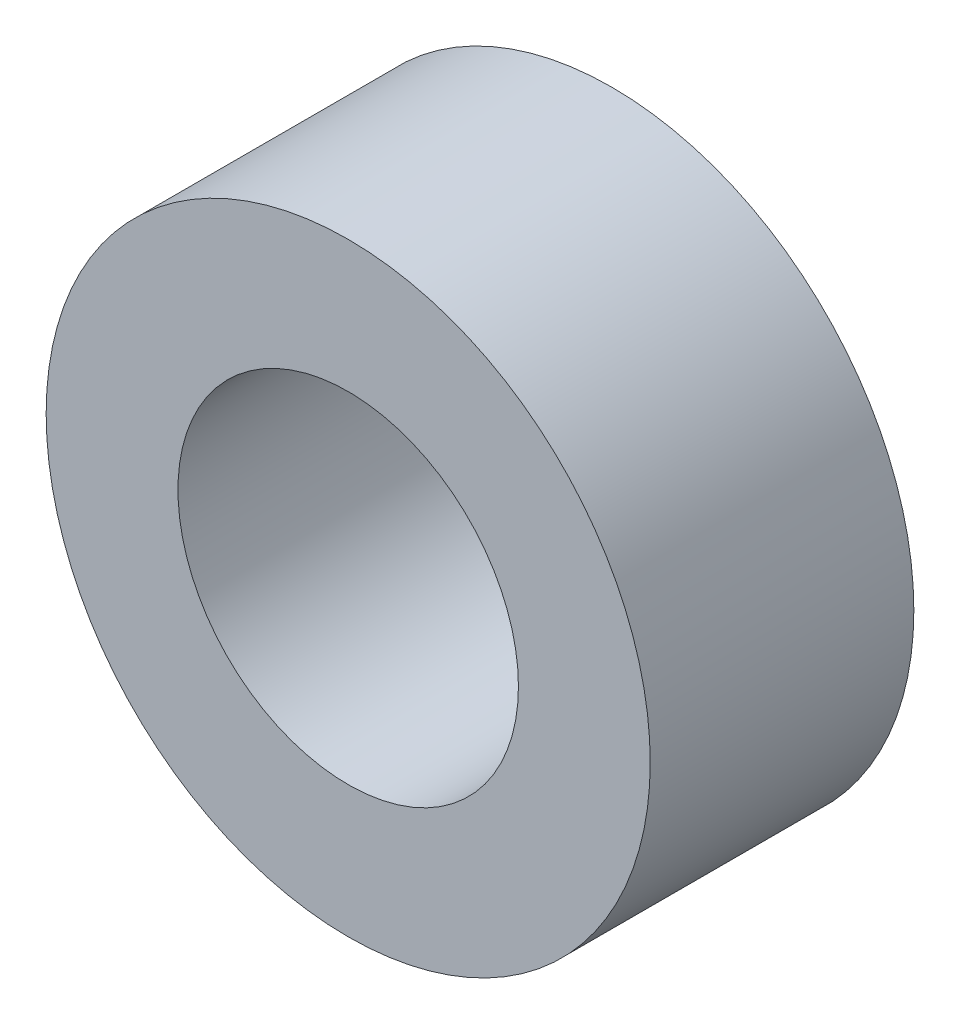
ISO-10303-21;
HEADER;
FILE_DESCRIPTION(('STEP AP214'),'2;1');
FILE_NAME('part.step','',(''),(''),'','','');
FILE_SCHEMA(('AUTOMOTIVE_DESIGN { 1 0 10303 214 1 1 1 1 }'));
ENDSEC;
DATA;
#1=APPLICATION_CONTEXT('core data for automotive mechanical design processes');
#2=APPLICATION_PROTOCOL_DEFINITION('international standard','automotive_design',2000,#1);
#3=PRODUCT_CONTEXT('',#1,'mechanical');
#4=PRODUCT('Part','Part','',(#3));
#5=PRODUCT_RELATED_PRODUCT_CATEGORY('part','',(#4));
#6=PRODUCT_DEFINITION_FORMATION('','',#4);
#7=PRODUCT_DEFINITION_CONTEXT('part definition',#1,'design');
#8=PRODUCT_DEFINITION('design','',#6,#7);
#9=PRODUCT_DEFINITION_SHAPE('','',#8);
#10=(LENGTH_UNIT() NAMED_UNIT(*) SI_UNIT(.MILLI.,.METRE.));
#11=(NAMED_UNIT(*) PLANE_ANGLE_UNIT() SI_UNIT($,.RADIAN.));
#12=(NAMED_UNIT(*) SI_UNIT($,.STERADIAN.) SOLID_ANGLE_UNIT());
#13=UNCERTAINTY_MEASURE_WITH_UNIT(LENGTH_MEASURE(1.E-05),#10,'distance_accuracy_value','');
#14=(GEOMETRIC_REPRESENTATION_CONTEXT(3) GLOBAL_UNCERTAINTY_ASSIGNED_CONTEXT((#13)) GLOBAL_UNIT_ASSIGNED_CONTEXT((#10,
#11,#12)) REPRESENTATION_CONTEXT('',''));
#15=CARTESIAN_POINT('',(0.,0.,0.));
#16=DIRECTION('',(0.,0.,1.));
#17=DIRECTION('',(1.,0.,0.));
#18=AXIS2_PLACEMENT_3D('',#15,#16,#17);
#19=CARTESIAN_POINT('',(0.,-48.5,-13.));
#20=DIRECTION('',(0.,0.,1.));
#21=DIRECTION('',(1.,0.,0.));
#22=AXIS2_PLACEMENT_3D('',#19,#20,#21);
#23=CYLINDRICAL_SURFACE('',#22,1.55);
#24=DIRECTION('',(0.,0.,1.));
#25=VECTOR('',#24,1.);
#26=CARTESIAN_POINT('',(1.55,-48.5,-13.));
#27=LINE('',#26,#25);
#28=CARTESIAN_POINT('',(1.55,-48.5,-13.));
#29=VERTEX_POINT('',#28);
#30=CARTESIAN_POINT('',(1.55,-48.5,-10.6));
#31=VERTEX_POINT('',#30);
#32=EDGE_CURVE('E10',#29,#31,#27,.T.);
#33=ORIENTED_EDGE('',*,*,#32,.F.);
#34=CARTESIAN_POINT('',(0.,-48.5,-13.));
#35=DIRECTION('',(0.,0.,1.));
#36=DIRECTION('',(1.,0.,0.));
#37=AXIS2_PLACEMENT_3D('',#34,#35,#36);
#38=CIRCLE('',#37,1.55);
#39=EDGE_CURVE('E27',#29,#29,#38,.T.);
#40=ORIENTED_EDGE('',*,*,#39,.F.);
#41=ORIENTED_EDGE('',*,*,#32,.T.);
#42=CARTESIAN_POINT('',(0.,-48.5,-10.6));
#43=DIRECTION('',(0.,0.,1.));
#44=DIRECTION('',(1.,0.,0.));
#45=AXIS2_PLACEMENT_3D('',#42,#43,#44);
#46=CIRCLE('',#45,1.55);
#47=EDGE_CURVE('E20',#31,#31,#46,.T.);
#48=ORIENTED_EDGE('',*,*,#47,.T.);
#49=EDGE_LOOP('',(#33,#40,#41,#48));
#50=FACE_BOUND('',#49,.T.);
#51=ADVANCED_FACE('F16',(#50),#23,.F.);
#52=CARTESIAN_POINT('',(0.,-48.5,-13.));
#53=DIRECTION('',(0.,0.,1.));
#54=DIRECTION('',(0.,-1.,0.));
#55=AXIS2_PLACEMENT_3D('',#52,#53,#54);
#56=PLANE('',#55);
#57=ORIENTED_EDGE('',*,*,#39,.T.);
#58=EDGE_LOOP('',(#57));
#59=FACE_BOUND('',#58,.T.);
#60=CARTESIAN_POINT('',(0.,-48.5,-13.));
#61=DIRECTION('',(0.,0.,1.));
#62=DIRECTION('',(1.,0.,0.));
#63=AXIS2_PLACEMENT_3D('',#60,#61,#62);
#64=CIRCLE('',#63,2.75);
#65=CARTESIAN_POINT('',(2.75,-48.5,-13.));
#66=VERTEX_POINT('',#65);
#67=EDGE_CURVE('E55',#66,#66,#64,.T.);
#68=ORIENTED_EDGE('',*,*,#67,.F.);
#69=EDGE_LOOP('',(#68));
#70=FACE_BOUND('',#69,.T.);
#71=ADVANCED_FACE('F72',(#59,#70),#56,.F.);
#72=CARTESIAN_POINT('',(0.,-48.5,-10.6));
#73=DIRECTION('',(0.,0.,1.));
#74=DIRECTION('',(0.,-1.,0.));
#75=AXIS2_PLACEMENT_3D('',#72,#73,#74);
#76=PLANE('',#75);
#77=ORIENTED_EDGE('',*,*,#47,.F.);
#78=EDGE_LOOP('',(#77));
#79=FACE_BOUND('',#78,.T.);
#80=CARTESIAN_POINT('',(0.,-48.5,-10.6));
#81=DIRECTION('',(0.,0.,1.));
#82=DIRECTION('',(1.,0.,0.));
#83=AXIS2_PLACEMENT_3D('',#80,#81,#82);
#84=CIRCLE('',#83,2.75);
#85=CARTESIAN_POINT('',(2.75,-48.5,-10.6));
#86=VERTEX_POINT('',#85);
#87=EDGE_CURVE('E63',#86,#86,#84,.T.);
#88=ORIENTED_EDGE('',*,*,#87,.T.);
#89=EDGE_LOOP('',(#88));
#90=FACE_BOUND('',#89,.T.);
#91=ADVANCED_FACE('F70',(#79,#90),#76,.T.);
#92=CARTESIAN_POINT('',(0.,-48.5,-13.));
#93=DIRECTION('',(0.,0.,1.));
#94=DIRECTION('',(1.,0.,0.));
#95=AXIS2_PLACEMENT_3D('',#92,#93,#94);
#96=CYLINDRICAL_SURFACE('',#95,2.75);
#97=ORIENTED_EDGE('',*,*,#87,.F.);
#98=DIRECTION('',(0.,0.,1.));
#99=VECTOR('',#98,1.);
#100=CARTESIAN_POINT('',(2.75,-48.5,-13.));
#101=LINE('',#100,#99);
#102=EDGE_CURVE('E50',#66,#86,#101,.T.);
#103=ORIENTED_EDGE('',*,*,#102,.F.);
#104=ORIENTED_EDGE('',*,*,#67,.T.);
#105=ORIENTED_EDGE('',*,*,#102,.T.);
#106=EDGE_LOOP('',(#97,#103,#104,#105));
#107=FACE_BOUND('',#106,.T.);
#108=ADVANCED_FACE('F18',(#107),#96,.T.);
#109=CLOSED_SHELL('',(#51,#71,#91,#108));
#110=MANIFOLD_SOLID_BREP('B1',#109);
#111=ADVANCED_BREP_SHAPE_REPRESENTATION('',(#18,#110),#14);
#112=SHAPE_DEFINITION_REPRESENTATION(#9,#111);
ENDSEC;
END-ISO-10303-21;
